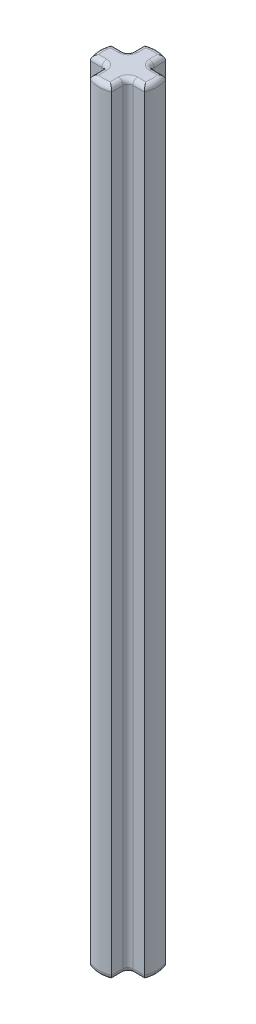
from build123d import *

# Parameters (mm, degrees)
BOSS_EXTRUDE1_DEPTH = 64
FILLET7_R           = 0.4


with BuildPart() as part:
    # Sketch1 → Boss-Extrude1 (new body)
    with BuildSketch(Plane(origin=(0, 0, 0), x_dir=(1, 0, 0), z_dir=(0, 1, 0))):
        with BuildLine():
            Line((-2.232845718, 0.88), (-0.88, 0.88))
            Line((-0.88, 0.88), (-0.88, 2.232845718))
            ThreePointArc((-0.88, 2.232845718), (0, 2.4), (0.88, 2.232845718))
            Line((0.88, 2.232845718), (0.88, 0.88))
            Line((0.88, 0.88), (2.232845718, 0.88))
            ThreePointArc((2.232845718, 0.88), (2.4, 0), (2.232845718, -0.88))
            Line((2.232845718, -0.88), (0.88, -0.88))
            Line((0.88, -0.88), (0.88, -2.232845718))
            ThreePointArc((0.88, -2.232845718), (0, -2.4), (-0.88, -2.232845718))
            Line((-0.88, -2.232845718), (-0.88, -0.88))
            Line((-0.88, -0.88), (-2.232845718, -0.88))
            ThreePointArc((-2.232845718, -0.88), (-2.4, 0), (-2.232845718, 0.88))
        make_face()
    extrude(amount=BOSS_EXTRUDE1_DEPTH)

    # Fillet7
    fillet7_edges = [part.edges().sort_by_distance(p)[0] for p in [
        (-2.4, 64, 0),
        (0, 0, -2.4),
        (0.88, 0, -1.556422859),
        (1.556422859, 0, -0.88),
        (2.4, 0, 0),
        (1.556422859, 0, 0.88),
        (0.88, 0, 1.556422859),
        (-1.556422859, 64, 0.88),
        (0, 0, 2.4),
        (-0.88, 0, 1.556422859),
        (-1.556422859, 0, 0.88),
        (-2.4, 0, 0),
        (-1.556422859, 0, -0.88),
        (-0.88, 0, -1.556422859),
        (-0.88, 64, 1.556422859),
        (0, 64, 2.4),
        (0.88, 32, -0.88),
        (0.88, 32, 0.88),
        (-0.88, 32, 0.88),
        (-0.88, 32, -0.88),
        (0.88, 64, 1.556422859),
        (1.556422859, 64, 0.88),
        (2.4, 64, 0),
        (1.556422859, 64, -0.88),
        (0.88, 64, -1.556422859),
        (0, 64, -2.4),
        (-0.88, 64, -1.556422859),
        (-1.556422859, 64, -0.88),
    ]]
    fillet(fillet7_edges, radius=FILLET7_R)


solid = part.part
